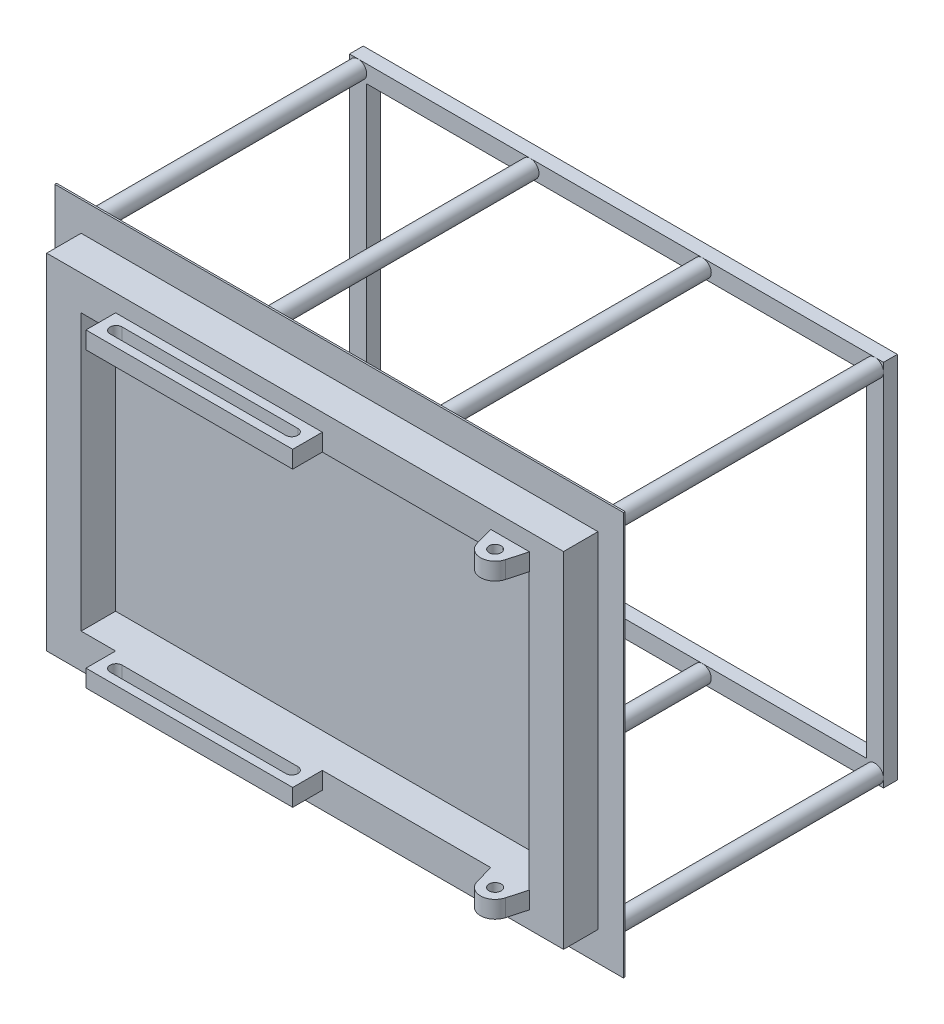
from build123d import *

# Parameters (mm, degrees)
SKETCH1_W                 = 3000
SKETCH1_H                 = 2000
SKETCH1_W_2               = 2600
SKETCH1_H_2               = 1600
BASE_EXTRUDE_DEPTH        = 100
SKETCH2_W                 = 2990
SKETCH2_H                 = 1990
SKETCH2_W_2               = 2610
SKETCH2_H_2               = 1610
CUT_EXTRUDE1_DEPTH        = 95
SKETCH3_W                 = 1200
SKETCH3_H                 = 172
BOSS_EXTRUDE2_DEPTH       = 100
SKETCH4_R                 = 35
BOSS_EXTRUDE3_DEPTH       = 100
SKETCH5_W                 = 3300
SKETCH5_H                 = 2340
BOSS_EXTRUDE4_DEPTH       = 10
SKETCH6_R                 = 50
BOSS_EXTRUDE5_DEPTH       = 1600
LPATTERN1_COUNT           = 4
LPATTERN1_PITCH           = 1000
LPATTERN2_COUNT           = 2
LPATTERN2_PITCH           = 2040
LPATTERN2_COPY_1_SKETCH_R = 50
LPATTERN2_COPY_1_DEPTH    = 1600
LPATTERN2_COPY_2_SKETCH_R = 50
LPATTERN2_COPY_2_DEPTH    = 1600
LPATTERN2_COPY_3_SKETCH_R = 50
LPATTERN2_COPY_3_DEPTH    = 1600
SKETCH7_W                 = 3100
SKETCH7_H                 = 2140
SKETCH7_W_2               = 2900
SKETCH7_H_2               = 1940
BOSS_EXTRUDE6_DEPTH       = 80


with BuildPart() as part:
    # Sketch1 → Base-Extrude (new, symmetric)
    with BuildSketch(Plane.XY):
        Rectangle(SKETCH1_W, SKETCH1_H)
        Rectangle(SKETCH1_W_2, SKETCH1_H_2, mode=Mode.SUBTRACT)
    extrude(amount=BASE_EXTRUDE_DEPTH, both=True)

    # Sketch2 → Cut-Extrude1 (cut, symmetric)
    with BuildSketch(Plane.XY):
        Rectangle(SKETCH2_W, SKETCH2_H)
        Rectangle(SKETCH2_W_2, SKETCH2_H_2, mode=Mode.SUBTRACT)
    extrude(amount=CUT_EXTRUDE1_DEPTH, both=True, mode=Mode.SUBTRACT)

    # Sketch3 → Boss-Extrude2 (add)
    with BuildSketch(Plane.XZ.offset(-800)):
        with Locations((-500, 186)):
            Rectangle(SKETCH3_W, SKETCH3_H)
        with BuildLine():
            Line((-1010, 222), (10, 222))
            ThreePointArc((10, 222), (45, 187), (10, 152))
            Line((10, 152), (-1010, 152))
            ThreePointArc((-1010, 152), (-1045, 187), (-1010, 222))
        make_face(mode=Mode.SUBTRACT)
    boss_extrude2 = extrude(amount=-BOSS_EXTRUDE2_DEPTH)

    # Mirror1: Boss-Extrude2 across plane
    add(boss_extrude2.mirror(Plane.ZX))

    # Sketch4 → Boss-Extrude3 (add)
    with BuildSketch(Plane.XZ.offset(-800)):
        with BuildLine():
            Line((1302.5, 100), (1271.876878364, 209.829296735))
            ThreePointArc((1271.876878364, 209.829296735), (1190, 272), (1108.123121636, 209.829296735))
            Line((1108.123121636, 209.829296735), (1077.5, 100))
            Line((1077.5, 100), (1302.5, 100))
        make_face()
        with Locations((1190, 187)):
            Circle(SKETCH4_R, mode=Mode.SUBTRACT)
    boss_extrude3 = extrude(amount=-BOSS_EXTRUDE3_DEPTH)

    # Mirror2: Boss-Extrude3 across plane
    add(boss_extrude3.mirror(Plane.ZX))

    # Sketch5 → Boss-Extrude4 (add)
    with BuildSketch(Plane(origin=(0, 0, -100), x_dir=(-1, 0, 0), z_dir=(0, 0, -1))):
        with Locations((2.5, 0)):
            Rectangle(SKETCH5_W, SKETCH5_H)
    extrude(amount=BOSS_EXTRUDE4_DEPTH)

    # Sketch6 → Boss-Extrude5 (add)
    with BuildSketch(Plane(origin=(0, 0, -110), x_dir=(-1, 0, 0), z_dir=(0, 0, -1))):
        with Locations((1502.5, 1020)):
            Circle(SKETCH6_R)
    boss_extrude5 = extrude(amount=BOSS_EXTRUDE5_DEPTH)

    # LPattern1: Boss-Extrude5 ×4
    with Locations(*[(i * LPATTERN1_PITCH, 0, 0) for i in range(1, LPATTERN1_COUNT)]):
        add(boss_extrude5)

    # LPattern2: Boss-Extrude5 ×2
    with Locations(*[(0, -i * LPATTERN2_PITCH, 0) for i in range(1, LPATTERN2_COUNT)]):
        add(boss_extrude5)

    # LPattern2 copy 1 sketch → LPattern2 copy 1 (add)
    with BuildSketch(Plane(origin=(1000, -2040, -110), x_dir=(-1, 0, 0), z_dir=(0, 0, -1))):
        with Locations((1502.5, 1020)):
            Circle(LPATTERN2_COPY_1_SKETCH_R)
    extrude(amount=LPATTERN2_COPY_1_DEPTH)

    # LPattern2 copy 2 sketch → LPattern2 copy 2 (add)
    with BuildSketch(Plane(origin=(2000, -2040, -110), x_dir=(-1, 0, 0), z_dir=(0, 0, -1))):
        with Locations((1502.5, 1020)):
            Circle(LPATTERN2_COPY_2_SKETCH_R)
    extrude(amount=LPATTERN2_COPY_2_DEPTH)

    # LPattern2 copy 3 sketch → LPattern2 copy 3 (add)
    with BuildSketch(Plane(origin=(3000, -2040, -110), x_dir=(-1, 0, 0), z_dir=(0, 0, -1))):
        with Locations((1502.5, 1020)):
            Circle(LPATTERN2_COPY_3_SKETCH_R)
    extrude(amount=LPATTERN2_COPY_3_DEPTH)

    # Sketch7 → Boss-Extrude6 (add)
    with BuildSketch(Plane(origin=(0, 0, -1710), x_dir=(-1, 0, 0), z_dir=(0, 0, -1))):
        with Locations((2.5, 0)):
            Rectangle(SKETCH7_W, SKETCH7_H)
        with Locations((2.5, 0)):
            Rectangle(SKETCH7_W_2, SKETCH7_H_2, mode=Mode.SUBTRACT)
    extrude(amount=BOSS_EXTRUDE6_DEPTH)


solid = part.part
